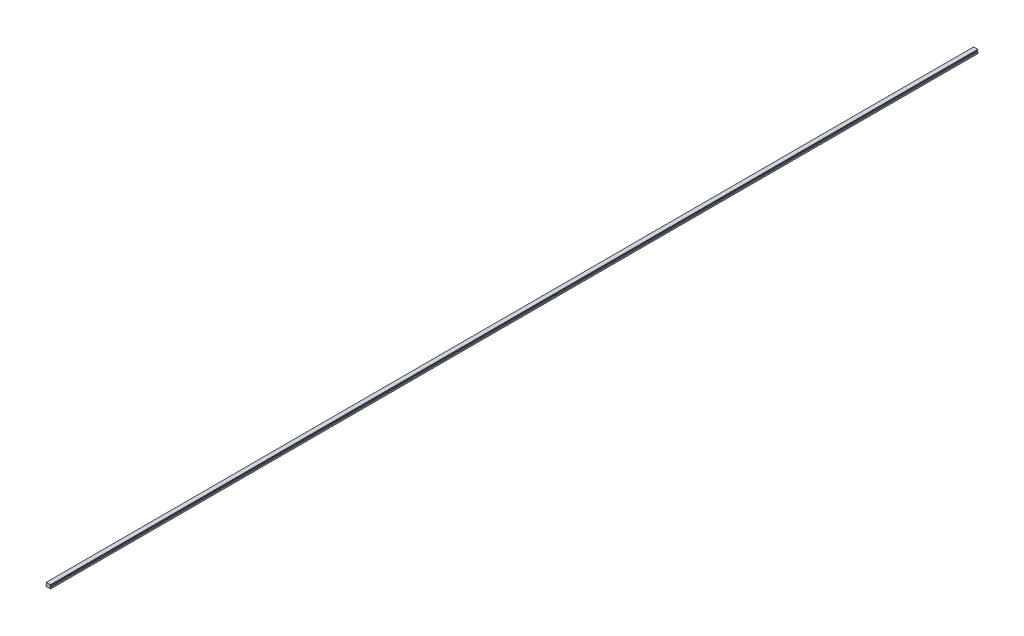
from build123d import *

# Parameters (mm, degrees)
SKETCH1_W           = 20
SKETCH1_H           = 16.3
BOSS_EXTRUDE1_DEPTH = 2000
CUT_EXTRUDE1_DEPTH  = 4001.045710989
CHAMFER1_SIZE       = 1
FILLET1_R           = 1
CUT_EXTRUDE2_DEPTH  = 4001.045710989
SKETCH5_R           = 3
SKETCH5_R_2         = 2.5
CUT_EXTRUDE5_DEPTH  = 10
SKETCH5_2_R         = 2.5
CUT_EXTRUDE6_DEPTH  = 13
LPATTERN2_COUNT     = 67
LPATTERN2_PITCH     = 60


with BuildPart() as part:
    # Sketch1 → Boss-Extrude1 (new, symmetric)
    with BuildSketch(Plane.XY):
        with Locations((0, 8.15)):
            Rectangle(SKETCH1_W, SKETCH1_H)
    extrude(amount=BOSS_EXTRUDE1_DEPTH, both=True)

    # Sketch2 → Cut-Extrude1 (cut, through all)
    with BuildSketch(Plane.XY.offset(2000)):
        Polygon((-10, 14.3), (-10, 7.3), (-7.666666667, 9.633333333), (-7.666666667, 11.966666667), align=None)
        Polygon((7.666666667, 11.966666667), (10, 14.3), (10, 7.3), (7.666666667, 9.633333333), align=None)
    extrude(amount=-CUT_EXTRUDE1_DEPTH, mode=Mode.SUBTRACT)

    # Chamfer1
    chamfer1_edges = [part.edges().sort_by_distance(p)[0] for p in [
        (-10, 16.3, 0),
        (10, 16.3, 0),
        (10, 0, 0),
        (-10, 0, 0),
    ]]
    chamfer(chamfer1_edges, length=CHAMFER1_SIZE)

    # Fillet1
    fillet1_edges = [part.edges().sort_by_distance(p)[0] for p in [
        (-7.666666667, 11.966666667, 0),
        (-7.666666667, 9.633333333, 0),
        (7.666666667, 9.633333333, 0),
        (7.666666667, 11.966666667, 0),
    ]]
    fillet(fillet1_edges, radius=FILLET1_R)

    # Sketch3 → Cut-Extrude2 (cut, through all)
    with BuildSketch(Plane.XY.offset(2000)):
        Polygon((-6, 0), (-5, 1), (5, 1), (6, 0), align=None)
    extrude(amount=-CUT_EXTRUDE2_DEPTH, mode=Mode.SUBTRACT)

    # Sketch5 → Cut-Extrude5 (cut)
    with BuildSketch(Plane.XZ.offset(-1)):
        with Locations(Location((0, 1980, 0), (0, 0, 270))):
            Circle(SKETCH5_R)
        with Locations(Location((0, 1980, 0), (0, 0, 270))):
            Circle(SKETCH5_R_2, mode=Mode.SUBTRACT)
    cut_extrude5 = extrude(amount=-CUT_EXTRUDE5_DEPTH, mode=Mode.SUBTRACT)

    # Sketch5_2 → Cut-Extrude6 (cut)
    with BuildSketch(Plane.XZ.offset(-1)):
        with Locations(Location((0, 1980, 0), (0, 0, 270))):
            Circle(SKETCH5_2_R)
    cut_extrude6 = extrude(amount=-CUT_EXTRUDE6_DEPTH, mode=Mode.SUBTRACT)

    # Cut-Extrude7 cone 1 section (on through the dimple's axis) → Cut-Extrude7 (revolve, cut)
    with BuildSketch(Plane(origin=(0, 14, 1980), x_dir=(0, 0, -1), z_dir=(1, 0, 0))):
        Polygon((0, 0), (2.5, 0), (0, 1.443375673), align=None)
    cut_extrude7 = revolve(axis=Axis((0, 14, 1980), (0, 1, 0)), mode=Mode.SUBTRACT)

    # LPattern2: Cut-Extrude5, Cut-Extrude6, Cut-Extrude7 ×67
    with Locations(*[(0, 0, -i * LPATTERN2_PITCH) for i in range(1, LPATTERN2_COUNT)]):
        add(cut_extrude5, mode=Mode.SUBTRACT)
        add(cut_extrude6, mode=Mode.SUBTRACT)
        add(cut_extrude7, mode=Mode.SUBTRACT)


solid = part.part
